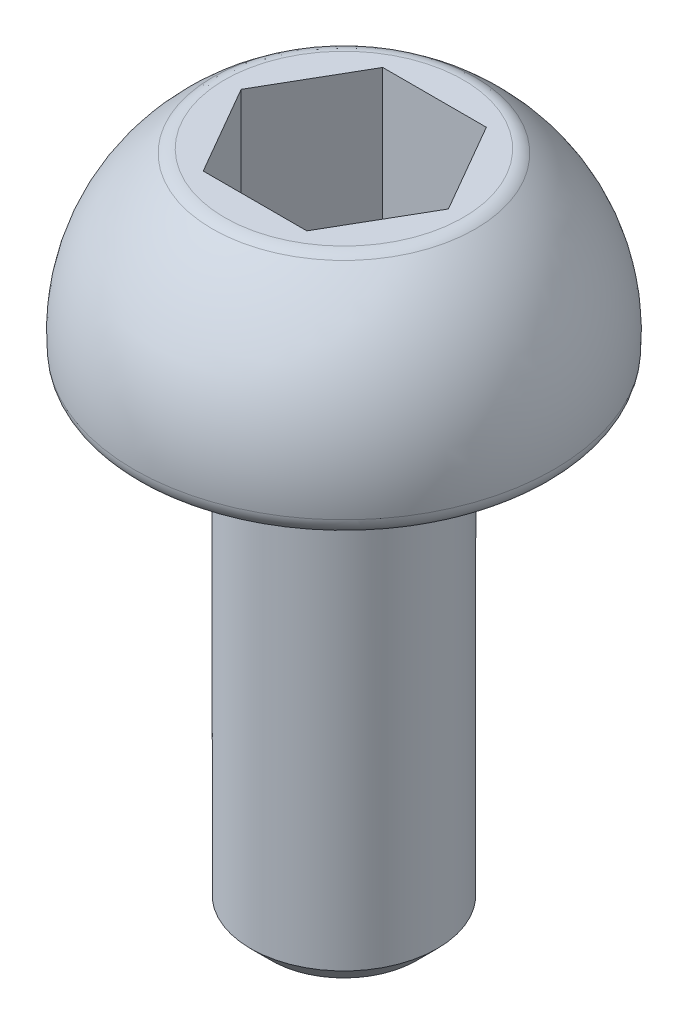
ISO-10303-21;
HEADER;
FILE_DESCRIPTION(('STEP AP214'),'2;1');
FILE_NAME('part.step','',(''),(''),'','','');
FILE_SCHEMA(('AUTOMOTIVE_DESIGN { 1 0 10303 214 1 1 1 1 }'));
ENDSEC;
DATA;
#1=APPLICATION_CONTEXT('core data for automotive mechanical design processes');
#2=APPLICATION_PROTOCOL_DEFINITION('international standard','automotive_design',2000,#1);
#3=PRODUCT_CONTEXT('',#1,'mechanical');
#4=PRODUCT('Part','Part','',(#3));
#5=PRODUCT_RELATED_PRODUCT_CATEGORY('part','',(#4));
#6=PRODUCT_DEFINITION_FORMATION('','',#4);
#7=PRODUCT_DEFINITION_CONTEXT('part definition',#1,'design');
#8=PRODUCT_DEFINITION('design','',#6,#7);
#9=PRODUCT_DEFINITION_SHAPE('','',#8);
#10=(LENGTH_UNIT() NAMED_UNIT(*) SI_UNIT(.MILLI.,.METRE.));
#11=(NAMED_UNIT(*) PLANE_ANGLE_UNIT() SI_UNIT($,.RADIAN.));
#12=(NAMED_UNIT(*) SI_UNIT($,.STERADIAN.) SOLID_ANGLE_UNIT());
#13=UNCERTAINTY_MEASURE_WITH_UNIT(LENGTH_MEASURE(1.E-05),#10,'distance_accuracy_value','');
#14=(GEOMETRIC_REPRESENTATION_CONTEXT(3) GLOBAL_UNCERTAINTY_ASSIGNED_CONTEXT((#13)) GLOBAL_UNIT_ASSIGNED_CONTEXT((#10,
#11,#12)) REPRESENTATION_CONTEXT('',''));
#15=CARTESIAN_POINT('',(0.,0.,0.));
#16=DIRECTION('',(0.,0.,1.));
#17=DIRECTION('',(1.,0.,0.));
#18=AXIS2_PLACEMENT_3D('',#15,#16,#17);
#19=CARTESIAN_POINT('',(339.97965057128,494.223605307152,0.));
#20=DIRECTION('',(0.,1.,0.));
#21=DIRECTION('',(0.,0.,1.));
#22=AXIS2_PLACEMENT_3D('',#19,#20,#21);
#23=PLANE('',#22);
#24=CARTESIAN_POINT('',(342.953817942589,494.223605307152,0.));
#25=DIRECTION('',(0.,1.,0.));
#26=DIRECTION('',(0.,0.,1.));
#27=AXIS2_PLACEMENT_3D('',#24,#25,#26);
#28=CIRCLE('',#27,2.82123183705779);
#29=CARTESIAN_POINT('',(342.953817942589,494.223605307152,2.82123183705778));
#30=VERTEX_POINT('',#29);
#31=EDGE_CURVE('E147',#30,#30,#28,.T.);
#32=ORIENTED_EDGE('',*,*,#31,.T.);
#33=EDGE_LOOP('',(#32));
#34=FACE_BOUND('',#33,.T.);
#35=DIRECTION('',(0.49999999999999,0.,-0.866025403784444));
#36=VECTOR('',#35,1.);
#37=CARTESIAN_POINT('',(344.198718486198,494.223605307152,2.12176223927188));
#38=LINE('',#37,#36);
#39=CARTESIAN_POINT('',(344.198718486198,494.223605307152,2.12176223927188));
#40=VERTEX_POINT('',#39);
#41=CARTESIAN_POINT('',(345.423718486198,494.223605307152,0.));
#42=VERTEX_POINT('',#41);
#43=EDGE_CURVE('E46',#40,#42,#38,.T.);
#44=ORIENTED_EDGE('',*,*,#43,.F.);
#45=DIRECTION('',(1.,0.,0.));
#46=VECTOR('',#45,1.);
#47=CARTESIAN_POINT('',(344.198718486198,494.223605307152,2.12176223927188));
#48=LINE('',#47,#46);
#49=CARTESIAN_POINT('',(341.748718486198,494.223605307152,2.12176223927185));
#50=VERTEX_POINT('',#49);
#51=EDGE_CURVE('E114',#50,#40,#48,.T.);
#52=ORIENTED_EDGE('',*,*,#51,.F.);
#53=DIRECTION('',(0.500000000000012,0.,0.866025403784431));
#54=VECTOR('',#53,1.);
#55=CARTESIAN_POINT('',(341.748718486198,494.223605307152,2.12176223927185));
#56=LINE('',#55,#54);
#57=CARTESIAN_POINT('',(340.523718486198,494.223605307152,0.));
#58=VERTEX_POINT('',#57);
#59=EDGE_CURVE('E108',#58,#50,#56,.T.);
#60=ORIENTED_EDGE('',*,*,#59,.F.);
#61=DIRECTION('',(-0.500000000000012,0.,0.866025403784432));
#62=VECTOR('',#61,1.);
#63=CARTESIAN_POINT('',(340.523718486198,494.223605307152,0.));
#64=LINE('',#63,#62);
#65=CARTESIAN_POINT('',(341.748718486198,494.223605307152,-2.12176223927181));
#66=VERTEX_POINT('',#65);
#67=EDGE_CURVE('E106',#66,#58,#64,.T.);
#68=ORIENTED_EDGE('',*,*,#67,.F.);
#69=DIRECTION('',(-1.,0.,0.));
#70=VECTOR('',#69,1.);
#71=CARTESIAN_POINT('',(341.748718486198,494.223605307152,-2.12176223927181));
#72=LINE('',#71,#70);
#73=CARTESIAN_POINT('',(344.198718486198,494.223605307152,-2.12176223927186));
#74=VERTEX_POINT('',#73);
#75=EDGE_CURVE('E89',#74,#66,#72,.T.);
#76=ORIENTED_EDGE('',*,*,#75,.F.);
#77=DIRECTION('',(-0.500000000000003,0.,-0.866025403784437));
#78=VECTOR('',#77,1.);
#79=CARTESIAN_POINT('',(345.423718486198,494.223605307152,0.));
#80=LINE('',#79,#78);
#81=EDGE_CURVE('E100',#42,#74,#80,.T.);
#82=ORIENTED_EDGE('',*,*,#81,.F.);
#83=EDGE_LOOP('',(#44,#52,#60,#68,#76,#82));
#84=FACE_BOUND('',#83,.T.);
#85=ADVANCED_FACE('F32',(#34,#84),#23,.T.);
#86=CARTESIAN_POINT('',(340.748817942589,478.455850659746,0.));
#87=DIRECTION('',(0.,-1.,0.));
#88=DIRECTION('',(0.,0.,-1.));
#89=AXIS2_PLACEMENT_3D('',#86,#87,#88);
#90=PLANE('',#89);
#91=CARTESIAN_POINT('',(342.953817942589,478.455850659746,0.));
#92=DIRECTION('',(0.,-1.,0.));
#93=DIRECTION('',(0.,0.,-1.));
#94=AXIS2_PLACEMENT_3D('',#91,#92,#93);
#95=CIRCLE('',#94,1.715);
#96=CARTESIAN_POINT('',(342.953817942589,478.455850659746,-1.715));
#97=VERTEX_POINT('',#96);
#98=EDGE_CURVE('E144',#97,#97,#95,.T.);
#99=ORIENTED_EDGE('',*,*,#98,.T.);
#100=EDGE_LOOP('',(#99));
#101=FACE_BOUND('',#100,.T.);
#102=ADVANCED_FACE('F171',(#101),#90,.T.);
#103=CARTESIAN_POINT('',(342.953817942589,494.223605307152,0.));
#104=DIRECTION('',(0.,1.,0.));
#105=DIRECTION('',(0.,0.,1.));
#106=AXIS2_PLACEMENT_3D('',#103,#104,#105);
#107=CYLINDRICAL_SURFACE('',#106,2.205);
#108=CARTESIAN_POINT('',(342.953817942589,478.945850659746,0.));
#109=DIRECTION('',(0.,-1.,0.));
#110=DIRECTION('',(0.,0.,-1.));
#111=AXIS2_PLACEMENT_3D('',#108,#109,#110);
#112=CIRCLE('',#111,2.205);
#113=CARTESIAN_POINT('',(342.953817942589,478.945850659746,-2.205));
#114=VERTEX_POINT('',#113);
#115=EDGE_CURVE('E141',#114,#114,#112,.F.);
#116=ORIENTED_EDGE('',*,*,#115,.T.);
#117=EDGE_LOOP('',(#116));
#118=FACE_BOUND('',#117,.T.);
#119=CARTESIAN_POINT('',(342.953817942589,489.679843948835,0.));
#120=DIRECTION('',(0.,1.,0.));
#121=DIRECTION('',(0.,0.,1.));
#122=AXIS2_PLACEMENT_3D('',#119,#120,#121);
#123=CIRCLE('',#122,2.205);
#124=CARTESIAN_POINT('',(342.953817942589,489.679843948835,2.205));
#125=VERTEX_POINT('',#124);
#126=EDGE_CURVE('E132',#125,#125,#123,.T.);
#127=ORIENTED_EDGE('',*,*,#126,.F.);
#128=EDGE_LOOP('',(#127));
#129=FACE_BOUND('',#128,.T.);
#130=ADVANCED_FACE('F176',(#118,#129),#107,.T.);
#131=CARTESIAN_POINT('',(340.748817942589,489.679843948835,0.));
#132=DIRECTION('',(0.,-1.,0.));
#133=DIRECTION('',(0.,0.,-1.));
#134=AXIS2_PLACEMENT_3D('',#131,#132,#133);
#135=PLANE('',#134);
#136=CARTESIAN_POINT('',(342.953817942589,489.679843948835,0.));
#137=DIRECTION('',(0.,-1.,0.));
#138=DIRECTION('',(0.,0.,-1.));
#139=AXIS2_PLACEMENT_3D('',#136,#137,#138);
#140=CIRCLE('',#139,4.47087183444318);
#141=CARTESIAN_POINT('',(342.953817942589,489.679843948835,-4.47087183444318));
#142=VERTEX_POINT('',#141);
#143=EDGE_CURVE('E11',#142,#142,#140,.T.);
#144=ORIENTED_EDGE('',*,*,#143,.T.);
#145=EDGE_LOOP('',(#144));
#146=FACE_BOUND('',#145,.T.);
#147=ORIENTED_EDGE('',*,*,#126,.T.);
#148=EDGE_LOOP('',(#147));
#149=FACE_BOUND('',#148,.T.);
#150=ADVANCED_FACE('F183',(#146,#149),#135,.T.);
#151=CARTESIAN_POINT('',(342.953817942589,490.489607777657,0.));
#152=DIRECTION('',(0.,1.,0.));
#153=DIRECTION('',(0.,0.,1.));
#154=AXIS2_PLACEMENT_3D('',#151,#152,#153);
#155=DEGENERATE_TOROIDAL_SURFACE('',#154,0.487401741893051,4.48628363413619,.T.);
#156=CARTESIAN_POINT('',(342.953817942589,490.130636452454,0.));
#157=DIRECTION('',(0.,1.,0.));
#158=DIRECTION('',(0.,0.,1.));
#159=AXIS2_PLACEMENT_3D('',#156,#157,#158);
#160=CIRCLE('',#159,4.95930071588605);
#161=CARTESIAN_POINT('',(342.953817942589,490.130636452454,4.95930071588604));
#162=VERTEX_POINT('',#161);
#163=EDGE_CURVE('E39',#162,#162,#160,.T.);
#164=ORIENTED_EDGE('',*,*,#163,.T.);
#165=EDGE_LOOP('',(#164));
#166=FACE_BOUND('',#165,.T.);
#167=CARTESIAN_POINT('',(342.953817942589,494.131364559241,0.));
#168=DIRECTION('',(0.,-1.,0.));
#169=DIRECTION('',(0.,0.,-1.));
#170=AXIS2_PLACEMENT_3D('',#167,#168,#169);
#171=CIRCLE('',#170,3.10739189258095);
#172=CARTESIAN_POINT('',(342.953817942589,494.131364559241,-3.10739189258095));
#173=VERTEX_POINT('',#172);
#174=EDGE_CURVE('E150',#173,#173,#171,.T.);
#175=ORIENTED_EDGE('',*,*,#174,.T.);
#176=EDGE_LOOP('',(#175));
#177=FACE_BOUND('',#176,.T.);
#178=ADVANCED_FACE('F155',(#166,#177),#155,.T.);
#179=CARTESIAN_POINT('',(342.953817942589,478.945850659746,0.));
#180=DIRECTION('',(0.,1.,0.));
#181=DIRECTION('',(0.,0.,1.));
#182=AXIS2_PLACEMENT_3D('',#179,#180,#181);
#183=CONICAL_SURFACE('',#182,2.205,0.785398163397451);
#184=ORIENTED_EDGE('',*,*,#98,.F.);
#185=EDGE_LOOP('',(#184));
#186=FACE_BOUND('',#185,.T.);
#187=ORIENTED_EDGE('',*,*,#115,.F.);
#188=EDGE_LOOP('',(#187));
#189=FACE_BOUND('',#188,.T.);
#190=ADVANCED_FACE('F192',(#186,#189),#183,.T.);
#191=CARTESIAN_POINT('',(344.198718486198,490.793605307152,2.12176223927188));
#192=DIRECTION('',(0.866025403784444,0.,0.49999999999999));
#193=DIRECTION('',(0.49999999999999,0.,-0.866025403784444));
#194=AXIS2_PLACEMENT_3D('',#191,#192,#193);
#195=PLANE('',#194);
#196=ORIENTED_EDGE('',*,*,#43,.T.);
#197=DIRECTION('',(0.,1.,0.));
#198=VECTOR('',#197,1.);
#199=CARTESIAN_POINT('',(345.423718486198,490.793605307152,0.));
#200=LINE('',#199,#198);
#201=CARTESIAN_POINT('',(345.423718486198,490.793605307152,0.));
#202=VERTEX_POINT('',#201);
#203=EDGE_CURVE('E97',#202,#42,#200,.T.);
#204=ORIENTED_EDGE('',*,*,#203,.F.);
#205=DIRECTION('',(0.49999999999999,0.,-0.866025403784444));
#206=VECTOR('',#205,1.);
#207=CARTESIAN_POINT('',(344.198718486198,490.793605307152,2.12176223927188));
#208=LINE('',#207,#206);
#209=CARTESIAN_POINT('',(344.198718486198,490.793605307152,2.12176223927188));
#210=VERTEX_POINT('',#209);
#211=EDGE_CURVE('E116',#210,#202,#208,.T.);
#212=ORIENTED_EDGE('',*,*,#211,.F.);
#213=DIRECTION('',(0.,1.,0.));
#214=VECTOR('',#213,1.);
#215=CARTESIAN_POINT('',(344.198718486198,490.793605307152,2.12176223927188));
#216=LINE('',#215,#214);
#217=EDGE_CURVE('E53',#210,#40,#216,.T.);
#218=ORIENTED_EDGE('',*,*,#217,.T.);
#219=EDGE_LOOP('',(#196,#204,#212,#218));
#220=FACE_BOUND('',#219,.T.);
#221=ADVANCED_FACE('F195',(#220),#195,.F.);
#222=CARTESIAN_POINT('',(344.198718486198,490.793605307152,2.12176223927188));
#223=DIRECTION('',(0.,0.,1.));
#224=DIRECTION('',(1.,0.,0.));
#225=AXIS2_PLACEMENT_3D('',#222,#223,#224);
#226=PLANE('',#225);
#227=ORIENTED_EDGE('',*,*,#51,.T.);
#228=ORIENTED_EDGE('',*,*,#217,.F.);
#229=DIRECTION('',(1.,0.,0.));
#230=VECTOR('',#229,1.);
#231=CARTESIAN_POINT('',(344.198718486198,490.793605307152,2.12176223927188));
#232=LINE('',#231,#230);
#233=CARTESIAN_POINT('',(341.748718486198,490.793605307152,2.12176223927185));
#234=VERTEX_POINT('',#233);
#235=EDGE_CURVE('E128',#234,#210,#232,.T.);
#236=ORIENTED_EDGE('',*,*,#235,.F.);
#237=DIRECTION('',(0.,1.,0.));
#238=VECTOR('',#237,1.);
#239=CARTESIAN_POINT('',(341.748718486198,490.793605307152,2.12176223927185));
#240=LINE('',#239,#238);
#241=EDGE_CURVE('E133',#234,#50,#240,.T.);
#242=ORIENTED_EDGE('',*,*,#241,.T.);
#243=EDGE_LOOP('',(#227,#228,#236,#242));
#244=FACE_BOUND('',#243,.T.);
#245=ADVANCED_FACE('F199',(#244),#226,.F.);
#246=CARTESIAN_POINT('',(341.748718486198,490.793605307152,2.12176223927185));
#247=DIRECTION('',(-0.866025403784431,0.,0.500000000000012));
#248=DIRECTION('',(0.500000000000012,0.,0.866025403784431));
#249=AXIS2_PLACEMENT_3D('',#246,#247,#248);
#250=PLANE('',#249);
#251=ORIENTED_EDGE('',*,*,#59,.T.);
#252=ORIENTED_EDGE('',*,*,#241,.F.);
#253=DIRECTION('',(0.500000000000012,0.,0.866025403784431));
#254=VECTOR('',#253,1.);
#255=CARTESIAN_POINT('',(341.748718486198,490.793605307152,2.12176223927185));
#256=LINE('',#255,#254);
#257=CARTESIAN_POINT('',(340.523718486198,490.793605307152,0.));
#258=VERTEX_POINT('',#257);
#259=EDGE_CURVE('E125',#258,#234,#256,.T.);
#260=ORIENTED_EDGE('',*,*,#259,.F.);
#261=DIRECTION('',(0.,1.,0.));
#262=VECTOR('',#261,1.);
#263=CARTESIAN_POINT('',(340.523718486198,490.793605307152,0.));
#264=LINE('',#263,#262);
#265=EDGE_CURVE('E135',#258,#58,#264,.T.);
#266=ORIENTED_EDGE('',*,*,#265,.T.);
#267=EDGE_LOOP('',(#251,#252,#260,#266));
#268=FACE_BOUND('',#267,.T.);
#269=ADVANCED_FACE('F207',(#268),#250,.F.);
#270=CARTESIAN_POINT('',(340.523718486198,490.793605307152,0.));
#271=DIRECTION('',(-0.866025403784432,0.,-0.500000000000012));
#272=DIRECTION('',(-0.500000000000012,0.,0.866025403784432));
#273=AXIS2_PLACEMENT_3D('',#270,#271,#272);
#274=PLANE('',#273);
#275=ORIENTED_EDGE('',*,*,#67,.T.);
#276=ORIENTED_EDGE('',*,*,#265,.F.);
#277=DIRECTION('',(-0.500000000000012,0.,0.866025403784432));
#278=VECTOR('',#277,1.);
#279=CARTESIAN_POINT('',(340.523718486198,490.793605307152,0.));
#280=LINE('',#279,#278);
#281=CARTESIAN_POINT('',(341.748718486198,490.793605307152,-2.12176223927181));
#282=VERTEX_POINT('',#281);
#283=EDGE_CURVE('E122',#282,#258,#280,.T.);
#284=ORIENTED_EDGE('',*,*,#283,.F.);
#285=DIRECTION('',(0.,1.,0.));
#286=VECTOR('',#285,1.);
#287=CARTESIAN_POINT('',(341.748718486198,490.793605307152,-2.12176223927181));
#288=LINE('',#287,#286);
#289=EDGE_CURVE('E96',#282,#66,#288,.T.);
#290=ORIENTED_EDGE('',*,*,#289,.T.);
#291=EDGE_LOOP('',(#275,#276,#284,#290));
#292=FACE_BOUND('',#291,.T.);
#293=ADVANCED_FACE('F204',(#292),#274,.F.);
#294=CARTESIAN_POINT('',(341.748718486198,490.793605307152,-2.12176223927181));
#295=DIRECTION('',(0.,0.,-1.));
#296=DIRECTION('',(-1.,0.,0.));
#297=AXIS2_PLACEMENT_3D('',#294,#295,#296);
#298=PLANE('',#297);
#299=ORIENTED_EDGE('',*,*,#75,.T.);
#300=ORIENTED_EDGE('',*,*,#289,.F.);
#301=DIRECTION('',(-1.,0.,0.));
#302=VECTOR('',#301,1.);
#303=CARTESIAN_POINT('',(341.748718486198,490.793605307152,-2.12176223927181));
#304=LINE('',#303,#302);
#305=CARTESIAN_POINT('',(344.198718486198,490.793605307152,-2.12176223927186));
#306=VERTEX_POINT('',#305);
#307=EDGE_CURVE('E92',#306,#282,#304,.T.);
#308=ORIENTED_EDGE('',*,*,#307,.F.);
#309=DIRECTION('',(0.,1.,0.));
#310=VECTOR('',#309,1.);
#311=CARTESIAN_POINT('',(344.198718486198,490.793605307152,-2.12176223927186));
#312=LINE('',#311,#310);
#313=EDGE_CURVE('E85',#306,#74,#312,.T.);
#314=ORIENTED_EDGE('',*,*,#313,.T.);
#315=EDGE_LOOP('',(#299,#300,#308,#314));
#316=FACE_BOUND('',#315,.T.);
#317=ADVANCED_FACE('F87',(#316),#298,.F.);
#318=CARTESIAN_POINT('',(345.423718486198,490.793605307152,0.));
#319=DIRECTION('',(0.866025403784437,0.,-0.500000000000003));
#320=DIRECTION('',(-0.500000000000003,0.,-0.866025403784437));
#321=AXIS2_PLACEMENT_3D('',#318,#319,#320);
#322=PLANE('',#321);
#323=ORIENTED_EDGE('',*,*,#81,.T.);
#324=ORIENTED_EDGE('',*,*,#313,.F.);
#325=DIRECTION('',(-0.500000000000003,0.,-0.866025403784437));
#326=VECTOR('',#325,1.);
#327=CARTESIAN_POINT('',(345.423718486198,490.793605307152,0.));
#328=LINE('',#327,#326);
#329=EDGE_CURVE('E119',#202,#306,#328,.T.);
#330=ORIENTED_EDGE('',*,*,#329,.F.);
#331=ORIENTED_EDGE('',*,*,#203,.T.);
#332=EDGE_LOOP('',(#323,#324,#330,#331));
#333=FACE_BOUND('',#332,.T.);
#334=ADVANCED_FACE('F101',(#333),#322,.F.);
#335=CARTESIAN_POINT('',(344.198718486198,490.793605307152,2.12176223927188));
#336=DIRECTION('',(0.,1.,0.));
#337=DIRECTION('',(0.,0.,1.));
#338=AXIS2_PLACEMENT_3D('',#335,#336,#337);
#339=PLANE('',#338);
#340=ORIENTED_EDGE('',*,*,#211,.T.);
#341=ORIENTED_EDGE('',*,*,#329,.T.);
#342=ORIENTED_EDGE('',*,*,#307,.T.);
#343=ORIENTED_EDGE('',*,*,#283,.T.);
#344=ORIENTED_EDGE('',*,*,#259,.T.);
#345=ORIENTED_EDGE('',*,*,#235,.T.);
#346=EDGE_LOOP('',(#340,#341,#342,#343,#344,#345));
#347=FACE_BOUND('',#346,.T.);
#348=ADVANCED_FACE('F166',(#347),#339,.T.);
#349=CARTESIAN_POINT('',(342.953817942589,493.733605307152,0.));
#350=DIRECTION('',(0.,1.,0.));
#351=DIRECTION('',(0.,0.,1.));
#352=AXIS2_PLACEMENT_3D('',#349,#350,#351);
#353=TOROIDAL_SURFACE('',#352,2.82123183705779,0.49);
#354=ORIENTED_EDGE('',*,*,#174,.F.);
#355=EDGE_LOOP('',(#354));
#356=FACE_BOUND('',#355,.T.);
#357=ORIENTED_EDGE('',*,*,#31,.F.);
#358=EDGE_LOOP('',(#357));
#359=FACE_BOUND('',#358,.T.);
#360=ADVANCED_FACE('F160',(#356,#359),#353,.T.);
#361=CARTESIAN_POINT('',(342.953817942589,490.169843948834,0.));
#362=DIRECTION('',(0.,-1.,0.));
#363=DIRECTION('',(0.,0.,-1.));
#364=AXIS2_PLACEMENT_3D('',#361,#362,#363);
#365=TOROIDAL_SURFACE('',#364,4.47087183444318,0.49);
#366=ORIENTED_EDGE('',*,*,#143,.F.);
#367=EDGE_LOOP('',(#366));
#368=FACE_BOUND('',#367,.T.);
#369=ORIENTED_EDGE('',*,*,#163,.F.);
#370=EDGE_LOOP('',(#369));
#371=FACE_BOUND('',#370,.T.);
#372=ADVANCED_FACE('F158',(#368,#371),#365,.T.);
#373=CLOSED_SHELL('',(#85,#102,#130,#150,#178,#190,#221,#245,#269,#293,#317,#334,#348,#360,#372));
#374=MANIFOLD_SOLID_BREP('B2',#373);
#375=ADVANCED_BREP_SHAPE_REPRESENTATION('',(#18,#374),#14);
#376=SHAPE_DEFINITION_REPRESENTATION(#9,#375);
ENDSEC;
END-ISO-10303-21;
